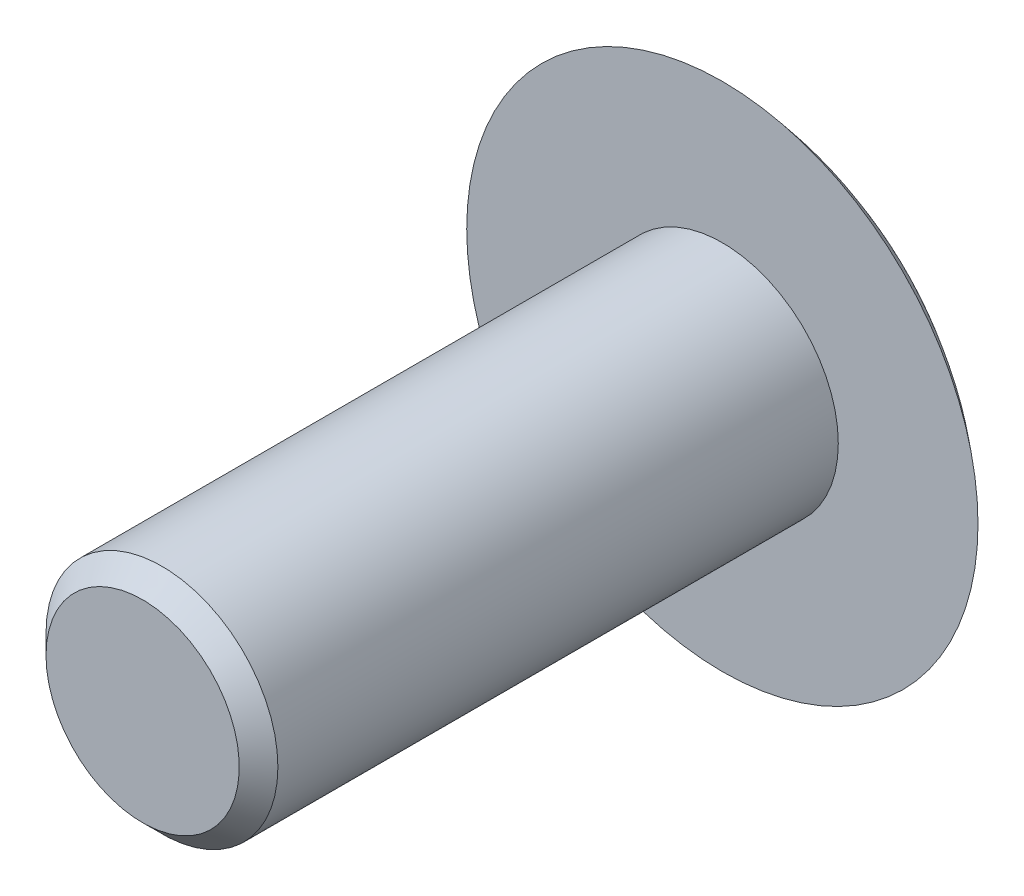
ISO-10303-21;
HEADER;
FILE_DESCRIPTION(('STEP AP214'),'2;1');
FILE_NAME('part.step','',(''),(''),'','','');
FILE_SCHEMA(('AUTOMOTIVE_DESIGN { 1 0 10303 214 1 1 1 1 }'));
ENDSEC;
DATA;
#1=APPLICATION_CONTEXT('core data for automotive mechanical design processes');
#2=APPLICATION_PROTOCOL_DEFINITION('international standard','automotive_design',2000,#1);
#3=PRODUCT_CONTEXT('',#1,'mechanical');
#4=PRODUCT('Part','Part','',(#3));
#5=PRODUCT_RELATED_PRODUCT_CATEGORY('part','',(#4));
#6=PRODUCT_DEFINITION_FORMATION('','',#4);
#7=PRODUCT_DEFINITION_CONTEXT('part definition',#1,'design');
#8=PRODUCT_DEFINITION('design','',#6,#7);
#9=PRODUCT_DEFINITION_SHAPE('','',#8);
#10=(LENGTH_UNIT() NAMED_UNIT(*) SI_UNIT(.MILLI.,.METRE.));
#11=(NAMED_UNIT(*) PLANE_ANGLE_UNIT() SI_UNIT($,.RADIAN.));
#12=(NAMED_UNIT(*) SI_UNIT($,.STERADIAN.) SOLID_ANGLE_UNIT());
#13=UNCERTAINTY_MEASURE_WITH_UNIT(LENGTH_MEASURE(1.E-05),#10,'distance_accuracy_value','');
#14=(GEOMETRIC_REPRESENTATION_CONTEXT(3) GLOBAL_UNCERTAINTY_ASSIGNED_CONTEXT((#13)) GLOBAL_UNIT_ASSIGNED_CONTEXT((#10,
#11,#12)) REPRESENTATION_CONTEXT('',''));
#15=CARTESIAN_POINT('',(0.,0.,0.));
#16=DIRECTION('',(0.,0.,1.));
#17=DIRECTION('',(1.,0.,0.));
#18=AXIS2_PLACEMENT_3D('',#15,#16,#17);
#19=CARTESIAN_POINT('',(-3.,0.,0.));
#20=DIRECTION('',(0.,0.,-1.));
#21=DIRECTION('',(-1.,0.,0.));
#22=AXIS2_PLACEMENT_3D('',#19,#20,#21);
#23=PLANE('',#22);
#24=CARTESIAN_POINT('',(0.,0.,0.));
#25=DIRECTION('',(0.,0.,-1.));
#26=DIRECTION('',(-1.,0.,0.));
#27=AXIS2_PLACEMENT_3D('',#24,#25,#26);
#28=CIRCLE('',#27,2.5);
#29=CARTESIAN_POINT('',(-2.5,0.,0.));
#30=VERTEX_POINT('',#29);
#31=EDGE_CURVE('E38',#30,#30,#28,.F.);
#32=ORIENTED_EDGE('',*,*,#31,.T.);
#33=EDGE_LOOP('',(#32));
#34=FACE_BOUND('',#33,.T.);
#35=ADVANCED_FACE('F31',(#34),#23,.F.);
#36=CARTESIAN_POINT('',(0.,0.,-7.5));
#37=DIRECTION('',(0.,0.,1.));
#38=DIRECTION('',(-1.,0.,0.));
#39=AXIS2_PLACEMENT_3D('',#36,#37,#38);
#40=SPHERICAL_SURFACE('',#39,10.);
#41=CARTESIAN_POINT('',(0.,0.,-15.));
#42=DIRECTION('',(0.,0.,1.));
#43=DIRECTION('',(1.,0.,0.));
#44=AXIS2_PLACEMENT_3D('',#41,#42,#43);
#45=CIRCLE('',#44,6.61437827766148);
#46=CARTESIAN_POINT('',(6.61437827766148,0.,-15.));
#47=VERTEX_POINT('',#46);
#48=EDGE_CURVE('E42',#47,#47,#45,.T.);
#49=ORIENTED_EDGE('',*,*,#48,.F.);
#50=EDGE_LOOP('',(#49));
#51=FACE_BOUND('',#50,.T.);
#52=ADVANCED_FACE('F57',(#51),#40,.T.);
#53=CARTESIAN_POINT('',(-6.61437827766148,0.,-15.));
#54=DIRECTION('',(0.,0.,-1.));
#55=DIRECTION('',(-1.,0.,0.));
#56=AXIS2_PLACEMENT_3D('',#53,#54,#55);
#57=PLANE('',#56);
#58=CARTESIAN_POINT('',(0.,0.,-15.));
#59=DIRECTION('',(0.,0.,1.));
#60=DIRECTION('',(1.,0.,0.));
#61=AXIS2_PLACEMENT_3D('',#58,#59,#60);
#62=CIRCLE('',#61,3.);
#63=CARTESIAN_POINT('',(3.,0.,-15.));
#64=VERTEX_POINT('',#63);
#65=EDGE_CURVE('E46',#64,#64,#62,.T.);
#66=ORIENTED_EDGE('',*,*,#65,.F.);
#67=EDGE_LOOP('',(#66));
#68=FACE_BOUND('',#67,.T.);
#69=ORIENTED_EDGE('',*,*,#48,.T.);
#70=EDGE_LOOP('',(#69));
#71=FACE_BOUND('',#70,.T.);
#72=ADVANCED_FACE('F54',(#68,#71),#57,.F.);
#73=CARTESIAN_POINT('',(0.,0.,0.));
#74=DIRECTION('',(0.,0.,1.));
#75=DIRECTION('',(1.,0.,0.));
#76=AXIS2_PLACEMENT_3D('',#73,#74,#75);
#77=CYLINDRICAL_SURFACE('',#76,3.);
#78=CARTESIAN_POINT('',(0.,0.,-0.500000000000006));
#79=DIRECTION('',(0.,0.,-1.));
#80=DIRECTION('',(-1.,0.,0.));
#81=AXIS2_PLACEMENT_3D('',#78,#79,#80);
#82=CIRCLE('',#81,3.);
#83=CARTESIAN_POINT('',(-3.,0.,-0.500000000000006));
#84=VERTEX_POINT('',#83);
#85=EDGE_CURVE('E10',#84,#84,#82,.T.);
#86=ORIENTED_EDGE('',*,*,#85,.T.);
#87=EDGE_LOOP('',(#86));
#88=FACE_BOUND('',#87,.T.);
#89=ORIENTED_EDGE('',*,*,#65,.T.);
#90=EDGE_LOOP('',(#89));
#91=FACE_BOUND('',#90,.T.);
#92=ADVANCED_FACE('F52',(#88,#91),#77,.T.);
#93=CARTESIAN_POINT('',(0.,0.,0.));
#94=DIRECTION('',(0.,0.,-1.));
#95=DIRECTION('',(-1.,0.,0.));
#96=AXIS2_PLACEMENT_3D('',#93,#94,#95);
#97=CONICAL_SURFACE('',#96,2.5,0.785398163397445);
#98=ORIENTED_EDGE('',*,*,#85,.F.);
#99=EDGE_LOOP('',(#98));
#100=FACE_BOUND('',#99,.T.);
#101=ORIENTED_EDGE('',*,*,#31,.F.);
#102=EDGE_LOOP('',(#101));
#103=FACE_BOUND('',#102,.T.);
#104=ADVANCED_FACE('F33',(#100,#103),#97,.T.);
#105=CLOSED_SHELL('',(#35,#52,#72,#92,#104));
#106=MANIFOLD_SOLID_BREP('B2',#105);
#107=ADVANCED_BREP_SHAPE_REPRESENTATION('',(#18,#106),#14);
#108=SHAPE_DEFINITION_REPRESENTATION(#9,#107);
ENDSEC;
END-ISO-10303-21;
